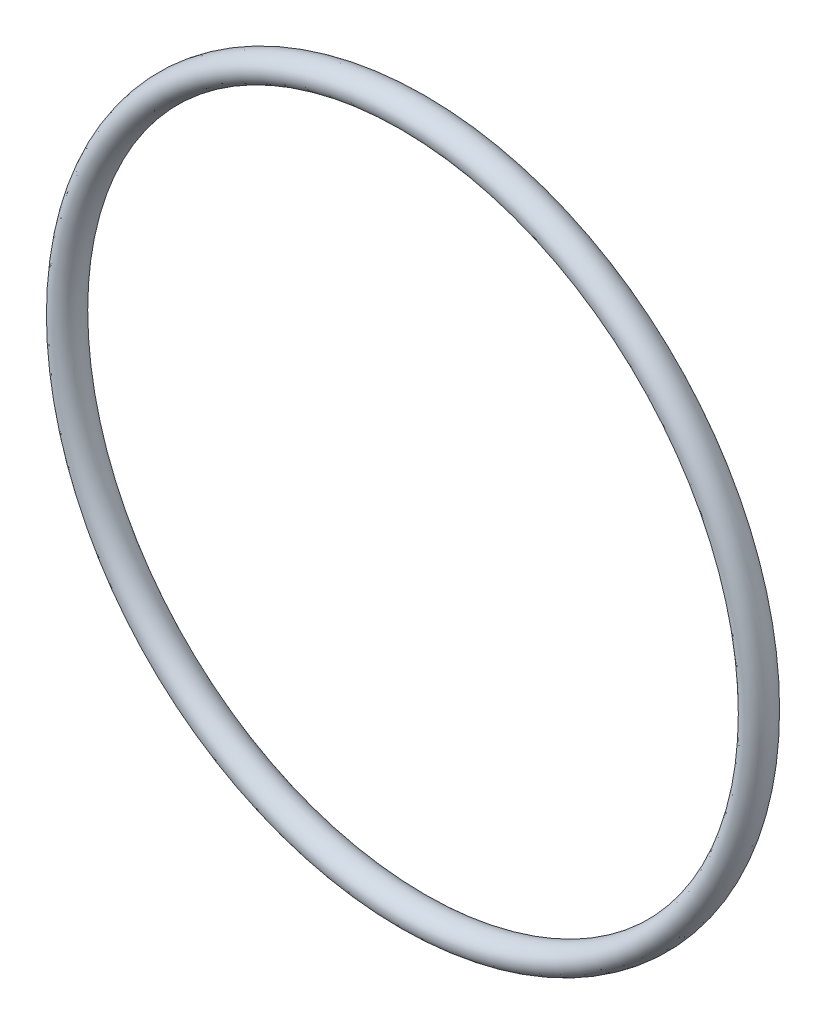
from build123d import *

# Parameters (mm, degrees)
ESQUISSE1_RX = 0.95
ESQUISSE1_RY = 0.8


with BuildPart() as part:
    # Esquisse1 → Base-R_volution (revolve)
    with BuildSketch(Plane(origin=(0, 0, 0), x_dir=(0, 0, -1), z_dir=(1, 0, 0))):
        with Locations((0.95, 20.8)):
            Ellipse(ESQUISSE1_RX, ESQUISSE1_RY)
    revolve(axis=Axis((0, 0, 0), (0, 0, -1)))


solid = part.part
